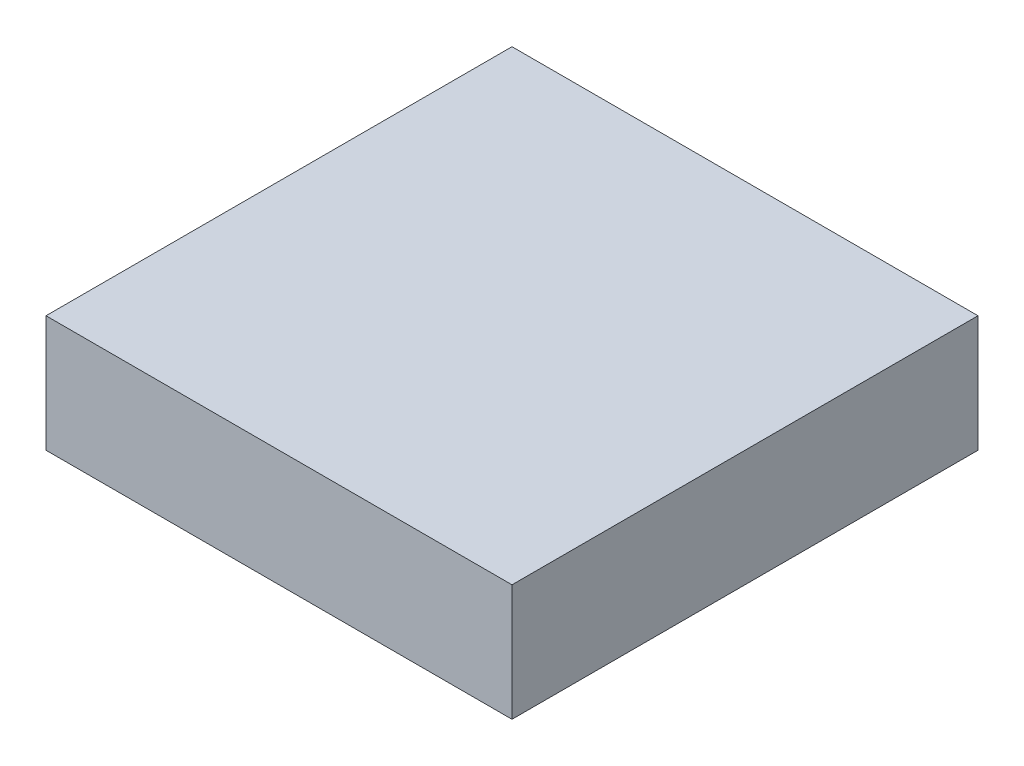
ISO-10303-21;
HEADER;
FILE_DESCRIPTION(('STEP AP214'),'2;1');
FILE_NAME('part.step','',(''),(''),'','','');
FILE_SCHEMA(('AUTOMOTIVE_DESIGN { 1 0 10303 214 1 1 1 1 }'));
ENDSEC;
DATA;
#1=APPLICATION_CONTEXT('core data for automotive mechanical design processes');
#2=APPLICATION_PROTOCOL_DEFINITION('international standard','automotive_design',2000,#1);
#3=PRODUCT_CONTEXT('',#1,'mechanical');
#4=PRODUCT('Part','Part','',(#3));
#5=PRODUCT_RELATED_PRODUCT_CATEGORY('part','',(#4));
#6=PRODUCT_DEFINITION_FORMATION('','',#4);
#7=PRODUCT_DEFINITION_CONTEXT('part definition',#1,'design');
#8=PRODUCT_DEFINITION('design','',#6,#7);
#9=PRODUCT_DEFINITION_SHAPE('','',#8);
#10=(LENGTH_UNIT() NAMED_UNIT(*) SI_UNIT(.MILLI.,.METRE.));
#11=(NAMED_UNIT(*) PLANE_ANGLE_UNIT() SI_UNIT($,.RADIAN.));
#12=(NAMED_UNIT(*) SI_UNIT($,.STERADIAN.) SOLID_ANGLE_UNIT());
#13=UNCERTAINTY_MEASURE_WITH_UNIT(LENGTH_MEASURE(1.E-05),#10,'distance_accuracy_value','');
#14=(GEOMETRIC_REPRESENTATION_CONTEXT(3) GLOBAL_UNCERTAINTY_ASSIGNED_CONTEXT((#13)) GLOBAL_UNIT_ASSIGNED_CONTEXT((#10,
#11,#12)) REPRESENTATION_CONTEXT('',''));
#15=CARTESIAN_POINT('',(0.,0.,0.));
#16=DIRECTION('',(0.,0.,1.));
#17=DIRECTION('',(1.,0.,0.));
#18=AXIS2_PLACEMENT_3D('',#15,#16,#17);
#19=CARTESIAN_POINT('',(-132.203389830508,50.,-94.3502824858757));
#20=DIRECTION('',(1.,0.,0.));
#21=DIRECTION('',(0.,0.,-1.));
#22=AXIS2_PLACEMENT_3D('',#19,#20,#21);
#23=PLANE('',#22);
#24=DIRECTION('',(0.,0.,1.));
#25=VECTOR('',#24,1.);
#26=CARTESIAN_POINT('',(-132.203389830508,0.,-94.3502824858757));
#27=LINE('',#26,#25);
#28=CARTESIAN_POINT('',(-132.203389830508,0.,-94.3502824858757));
#29=VERTEX_POINT('',#28);
#30=CARTESIAN_POINT('',(-132.203389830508,0.,105.649717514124));
#31=VERTEX_POINT('',#30);
#32=EDGE_CURVE('E98',#29,#31,#27,.T.);
#33=ORIENTED_EDGE('',*,*,#32,.T.);
#34=DIRECTION('',(0.,-1.,0.));
#35=VECTOR('',#34,1.);
#36=CARTESIAN_POINT('',(-132.203389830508,50.,105.649717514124));
#37=LINE('',#36,#35);
#38=CARTESIAN_POINT('',(-132.203389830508,50.,105.649717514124));
#39=VERTEX_POINT('',#38);
#40=EDGE_CURVE('E11',#39,#31,#37,.T.);
#41=ORIENTED_EDGE('',*,*,#40,.F.);
#42=DIRECTION('',(0.,0.,1.));
#43=VECTOR('',#42,1.);
#44=CARTESIAN_POINT('',(-132.203389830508,50.,-94.3502824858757));
#45=LINE('',#44,#43);
#46=CARTESIAN_POINT('',(-132.203389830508,50.,-94.3502824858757));
#47=VERTEX_POINT('',#46);
#48=EDGE_CURVE('E86',#47,#39,#45,.T.);
#49=ORIENTED_EDGE('',*,*,#48,.F.);
#50=DIRECTION('',(0.,-1.,0.));
#51=VECTOR('',#50,1.);
#52=CARTESIAN_POINT('',(-132.203389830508,50.,-94.3502824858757));
#53=LINE('',#52,#51);
#54=EDGE_CURVE('E94',#47,#29,#53,.T.);
#55=ORIENTED_EDGE('',*,*,#54,.T.);
#56=EDGE_LOOP('',(#33,#41,#49,#55));
#57=FACE_BOUND('',#56,.T.);
#58=ADVANCED_FACE('F35',(#57),#23,.F.);
#59=CARTESIAN_POINT('',(-132.203389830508,50.,105.649717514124));
#60=DIRECTION('',(0.,0.,-1.));
#61=DIRECTION('',(-1.,0.,0.));
#62=AXIS2_PLACEMENT_3D('',#59,#60,#61);
#63=PLANE('',#62);
#64=DIRECTION('',(1.,0.,0.));
#65=VECTOR('',#64,1.);
#66=CARTESIAN_POINT('',(-132.203389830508,0.,105.649717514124));
#67=LINE('',#66,#65);
#68=CARTESIAN_POINT('',(67.7966101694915,0.,105.649717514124));
#69=VERTEX_POINT('',#68);
#70=EDGE_CURVE('E90',#31,#69,#67,.T.);
#71=ORIENTED_EDGE('',*,*,#70,.T.);
#72=DIRECTION('',(0.,-1.,0.));
#73=VECTOR('',#72,1.);
#74=CARTESIAN_POINT('',(67.7966101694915,50.,105.649717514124));
#75=LINE('',#74,#73);
#76=CARTESIAN_POINT('',(67.7966101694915,50.,105.649717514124));
#77=VERTEX_POINT('',#76);
#78=EDGE_CURVE('E43',#77,#69,#75,.T.);
#79=ORIENTED_EDGE('',*,*,#78,.F.);
#80=DIRECTION('',(1.,0.,0.));
#81=VECTOR('',#80,1.);
#82=CARTESIAN_POINT('',(-132.203389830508,50.,105.649717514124));
#83=LINE('',#82,#81);
#84=EDGE_CURVE('E81',#39,#77,#83,.T.);
#85=ORIENTED_EDGE('',*,*,#84,.F.);
#86=ORIENTED_EDGE('',*,*,#40,.T.);
#87=EDGE_LOOP('',(#71,#79,#85,#86));
#88=FACE_BOUND('',#87,.T.);
#89=ADVANCED_FACE('F89',(#88),#63,.F.);
#90=CARTESIAN_POINT('',(67.7966101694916,50.,-94.3502824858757));
#91=DIRECTION('',(-1.,0.,0.));
#92=DIRECTION('',(0.,0.,1.));
#93=AXIS2_PLACEMENT_3D('',#90,#91,#92);
#94=PLANE('',#93);
#95=DIRECTION('',(0.,0.,-1.));
#96=VECTOR('',#95,1.);
#97=CARTESIAN_POINT('',(67.7966101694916,0.,-94.3502824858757));
#98=LINE('',#97,#96);
#99=CARTESIAN_POINT('',(67.7966101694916,0.,-94.3502824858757));
#100=VERTEX_POINT('',#99);
#101=EDGE_CURVE('E68',#69,#100,#98,.T.);
#102=ORIENTED_EDGE('',*,*,#101,.T.);
#103=DIRECTION('',(0.,-1.,0.));
#104=VECTOR('',#103,1.);
#105=CARTESIAN_POINT('',(67.7966101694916,50.,-94.3502824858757));
#106=LINE('',#105,#104);
#107=CARTESIAN_POINT('',(67.7966101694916,50.,-94.3502824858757));
#108=VERTEX_POINT('',#107);
#109=EDGE_CURVE('E91',#108,#100,#106,.T.);
#110=ORIENTED_EDGE('',*,*,#109,.F.);
#111=DIRECTION('',(0.,0.,-1.));
#112=VECTOR('',#111,1.);
#113=CARTESIAN_POINT('',(67.7966101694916,50.,-94.3502824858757));
#114=LINE('',#113,#112);
#115=EDGE_CURVE('E84',#77,#108,#114,.T.);
#116=ORIENTED_EDGE('',*,*,#115,.F.);
#117=ORIENTED_EDGE('',*,*,#78,.T.);
#118=EDGE_LOOP('',(#102,#110,#116,#117));
#119=FACE_BOUND('',#118,.T.);
#120=ADVANCED_FACE('F92',(#119),#94,.F.);
#121=CARTESIAN_POINT('',(-132.203389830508,50.,-94.3502824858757));
#122=DIRECTION('',(0.,0.,1.));
#123=DIRECTION('',(1.,0.,0.));
#124=AXIS2_PLACEMENT_3D('',#121,#122,#123);
#125=PLANE('',#124);
#126=DIRECTION('',(-1.,0.,0.));
#127=VECTOR('',#126,1.);
#128=CARTESIAN_POINT('',(-132.203389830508,0.,-94.3502824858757));
#129=LINE('',#128,#127);
#130=EDGE_CURVE('E74',#100,#29,#129,.T.);
#131=ORIENTED_EDGE('',*,*,#130,.T.);
#132=ORIENTED_EDGE('',*,*,#54,.F.);
#133=DIRECTION('',(-1.,0.,0.));
#134=VECTOR('',#133,1.);
#135=CARTESIAN_POINT('',(-132.203389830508,50.,-94.3502824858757));
#136=LINE('',#135,#134);
#137=EDGE_CURVE('E51',#108,#47,#136,.T.);
#138=ORIENTED_EDGE('',*,*,#137,.F.);
#139=ORIENTED_EDGE('',*,*,#109,.T.);
#140=EDGE_LOOP('',(#131,#132,#138,#139));
#141=FACE_BOUND('',#140,.T.);
#142=ADVANCED_FACE('F105',(#141),#125,.F.);
#143=CARTESIAN_POINT('',(0.,50.,0.));
#144=DIRECTION('',(0.,1.,0.));
#145=DIRECTION('',(0.,0.,1.));
#146=AXIS2_PLACEMENT_3D('',#143,#144,#145);
#147=PLANE('',#146);
#148=ORIENTED_EDGE('',*,*,#48,.T.);
#149=ORIENTED_EDGE('',*,*,#84,.T.);
#150=ORIENTED_EDGE('',*,*,#115,.T.);
#151=ORIENTED_EDGE('',*,*,#137,.T.);
#152=EDGE_LOOP('',(#148,#149,#150,#151));
#153=FACE_BOUND('',#152,.T.);
#154=ADVANCED_FACE('F82',(#153),#147,.T.);
#155=CARTESIAN_POINT('',(0.,0.,0.));
#156=DIRECTION('',(0.,1.,0.));
#157=DIRECTION('',(0.,0.,1.));
#158=AXIS2_PLACEMENT_3D('',#155,#156,#157);
#159=PLANE('',#158);
#160=ORIENTED_EDGE('',*,*,#32,.F.);
#161=ORIENTED_EDGE('',*,*,#130,.F.);
#162=ORIENTED_EDGE('',*,*,#101,.F.);
#163=ORIENTED_EDGE('',*,*,#70,.F.);
#164=EDGE_LOOP('',(#160,#161,#162,#163));
#165=FACE_BOUND('',#164,.T.);
#166=ADVANCED_FACE('F108',(#165),#159,.F.);
#167=CLOSED_SHELL('',(#58,#89,#120,#142,#154,#166));
#168=MANIFOLD_SOLID_BREP('B2',#167);
#169=ADVANCED_BREP_SHAPE_REPRESENTATION('',(#18,#168),#14);
#170=SHAPE_DEFINITION_REPRESENTATION(#9,#169);
ENDSEC;
END-ISO-10303-21;
